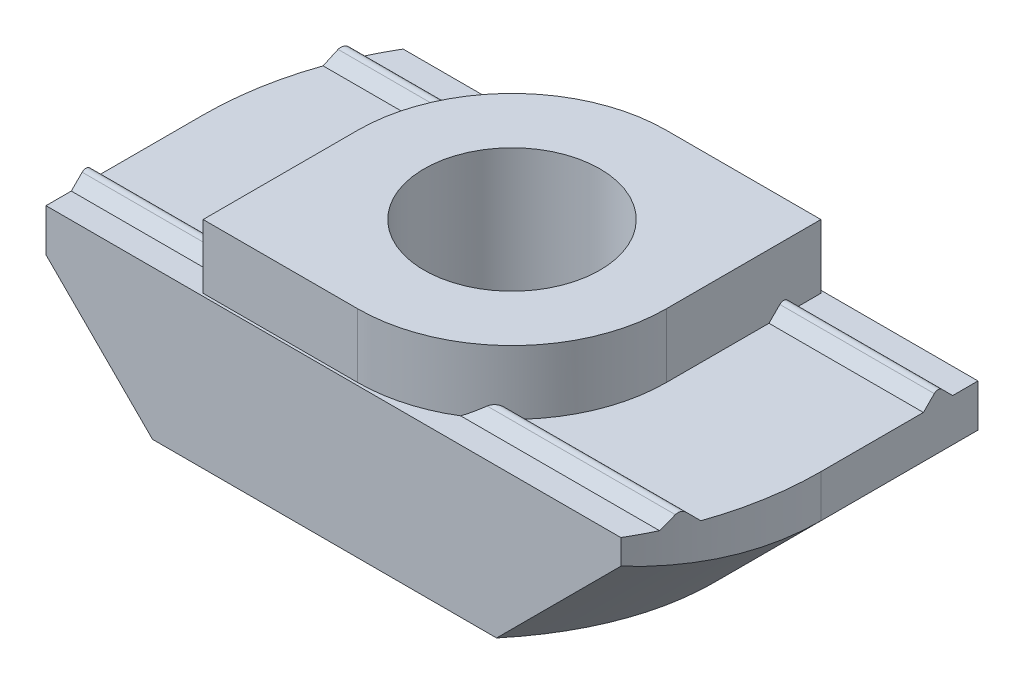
ISO-10303-21;
HEADER;
FILE_DESCRIPTION(('STEP AP214'),'2;1');
FILE_NAME('part.step','',(''),(''),'','','');
FILE_SCHEMA(('AUTOMOTIVE_DESIGN { 1 0 10303 214 1 1 1 1 }'));
ENDSEC;
DATA;
#1=APPLICATION_CONTEXT('core data for automotive mechanical design processes');
#2=APPLICATION_PROTOCOL_DEFINITION('international standard','automotive_design',2000,#1);
#3=PRODUCT_CONTEXT('',#1,'mechanical');
#4=PRODUCT('Part','Part','',(#3));
#5=PRODUCT_RELATED_PRODUCT_CATEGORY('part','',(#4));
#6=PRODUCT_DEFINITION_FORMATION('','',#4);
#7=PRODUCT_DEFINITION_CONTEXT('part definition',#1,'design');
#8=PRODUCT_DEFINITION('design','',#6,#7);
#9=PRODUCT_DEFINITION_SHAPE('','',#8);
#10=(LENGTH_UNIT() NAMED_UNIT(*) SI_UNIT(.MILLI.,.METRE.));
#11=(NAMED_UNIT(*) PLANE_ANGLE_UNIT() SI_UNIT($,.RADIAN.));
#12=(NAMED_UNIT(*) SI_UNIT($,.STERADIAN.) SOLID_ANGLE_UNIT());
#13=UNCERTAINTY_MEASURE_WITH_UNIT(LENGTH_MEASURE(1.E-05),#10,'distance_accuracy_value','');
#14=(GEOMETRIC_REPRESENTATION_CONTEXT(3) GLOBAL_UNCERTAINTY_ASSIGNED_CONTEXT((#13)) GLOBAL_UNIT_ASSIGNED_CONTEXT((#10,
#11,#12)) REPRESENTATION_CONTEXT('',''));
#15=CARTESIAN_POINT('',(0.,0.,0.));
#16=DIRECTION('',(0.,0.,1.));
#17=DIRECTION('',(1.,0.,0.));
#18=AXIS2_PLACEMENT_3D('',#15,#16,#17);
#19=CARTESIAN_POINT('',(5.8,-0.0964213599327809,-2.19999999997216));
#20=DIRECTION('',(-1.,0.,0.));
#21=DIRECTION('',(0.,0.,1.));
#22=AXIS2_PLACEMENT_3D('',#19,#20,#21);
#23=CYLINDRICAL_SURFACE('',#22,0.100000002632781);
#24=CARTESIAN_POINT('',(5.8,-0.0964213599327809,-2.19999999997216));
#25=DIRECTION('',(-1.,0.,0.));
#26=DIRECTION('',(0.,0.,1.));
#27=AXIS2_PLACEMENT_3D('',#24,#25,#26);
#28=CIRCLE('',#27,0.100000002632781);
#29=CARTESIAN_POINT('',(5.8,-0.0257106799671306,-2.12928931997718));
#30=VERTEX_POINT('',#29);
#31=CARTESIAN_POINT('',(5.8,-0.0257106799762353,-2.27071067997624));
#32=VERTEX_POINT('',#31);
#33=EDGE_CURVE('E19',#30,#32,#28,.T.);
#34=ORIENTED_EDGE('',*,*,#33,.T.);
#35=DIRECTION('',(1.,0.,0.));
#36=VECTOR('',#35,1.);
#37=CARTESIAN_POINT('',(5.8,-0.0257106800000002,-2.27071068));
#38=LINE('',#37,#36);
#39=CARTESIAN_POINT('',(2.9,-0.0257106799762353,-2.27071067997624));
#40=VERTEX_POINT('',#39);
#41=EDGE_CURVE('E600',#40,#32,#38,.T.);
#42=ORIENTED_EDGE('',*,*,#41,.F.);
#43=CARTESIAN_POINT('',(2.9,-0.0964213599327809,-2.19999999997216));
#44=DIRECTION('',(-1.,0.,0.));
#45=DIRECTION('',(0.,0.,1.));
#46=AXIS2_PLACEMENT_3D('',#43,#44,#45);
#47=CIRCLE('',#46,0.100000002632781);
#48=CARTESIAN_POINT('',(2.9,-0.0257106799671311,-2.12928931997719));
#49=VERTEX_POINT('',#48);
#50=EDGE_CURVE('E205',#49,#40,#47,.T.);
#51=ORIENTED_EDGE('',*,*,#50,.F.);
#52=DIRECTION('',(1.,0.,0.));
#53=VECTOR('',#52,1.);
#54=CARTESIAN_POINT('',(5.8,-0.0257106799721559,-2.12928931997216));
#55=LINE('',#54,#53);
#56=EDGE_CURVE('E184',#30,#49,#55,.F.);
#57=ORIENTED_EDGE('',*,*,#56,.F.);
#58=EDGE_LOOP('',(#34,#42,#51,#57));
#59=FACE_BOUND('',#58,.T.);
#60=ADVANCED_FACE('F16',(#59),#23,.T.);
#61=CARTESIAN_POINT('',(5.8,-0.0964213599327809,-2.19999999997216));
#62=DIRECTION('',(-1.,0.,0.));
#63=DIRECTION('',(0.,0.,1.));
#64=AXIS2_PLACEMENT_3D('',#61,#62,#63);
#65=CYLINDRICAL_SURFACE('',#64,0.100000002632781);
#66=CARTESIAN_POINT('',(-5.33702848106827,-0.025710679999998,-2.27071068));
#67=CARTESIAN_POINT('',(-5.33882524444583,-0.021484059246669,-2.26648822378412));
#68=CARTESIAN_POINT('',(-5.34076270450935,-0.017676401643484,-2.26191999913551));
#69=CARTESIAN_POINT('',(-5.34484278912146,-0.0109634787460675,-2.25226156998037));
#70=CARTESIAN_POINT('',(-5.34698488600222,-0.00805597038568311,-2.24717270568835));
#71=CARTESIAN_POINT('',(-5.35140504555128,-0.00318900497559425,-2.23662622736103));
#72=CARTESIAN_POINT('',(-5.35368293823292,-0.00122838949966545,-2.23116907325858));
#73=CARTESIAN_POINT('',(-5.35831323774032,0.00172232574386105,-2.22002603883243));
#74=CARTESIAN_POINT('',(-5.36066568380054,0.00271190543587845,-2.21434003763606));
#75=CARTESIAN_POINT('',(-5.36548778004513,0.00372421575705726,-2.20263086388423));
#76=CARTESIAN_POINT('',(-5.36795797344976,0.00370180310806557,-2.1966039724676));
#77=CARTESIAN_POINT('',(-5.37284378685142,0.00257276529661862,-2.18462616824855));
#78=CARTESIAN_POINT('',(-5.37525938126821,0.00146564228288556,-2.17867529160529));
#79=CARTESIAN_POINT('',(-5.37998414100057,-0.00183273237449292,-2.16698194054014));
#80=CARTESIAN_POINT('',(-5.38229238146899,-0.00403198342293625,-2.16124134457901));
#81=CARTESIAN_POINT('',(-5.38670996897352,-0.00948243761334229,-2.15020717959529));
#82=CARTESIAN_POINT('',(-5.38881970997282,-0.0127314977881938,-2.14491272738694));
#83=CARTESIAN_POINT('',(-5.39153718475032,-0.0178730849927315,-2.13806709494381));
#84=CARTESIAN_POINT('',(-5.39226144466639,-0.0193487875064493,-2.13623973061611));
#85=CARTESIAN_POINT('',(-5.39366762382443,-0.0224318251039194,-2.13268684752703));
#86=CARTESIAN_POINT('',(-5.39434959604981,-0.0240389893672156,-2.13096120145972));
#87=CARTESIAN_POINT('',(-5.39500945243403,-0.0257106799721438,-2.12928931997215));
#88=B_SPLINE_CURVE_WITH_KNOTS('',3,(#66,#67,#68,#69,#70,#71,#72,#73,#74,#75,#76,#77,#78,#79,#80,
#81,#82,#83,#84,#85,#86,#87),.UNSPECIFIED.,.F.,.F.,(4,2,2,2,2,2,2,2,2,2,4),(0.,
0.0186784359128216,0.037309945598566,0.05591860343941,0.0745372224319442,0.0939871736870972,
0.113446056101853,0.133049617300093,0.152613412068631,0.1599824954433,0.167342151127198),.UNSPECIFIED.);
#89=CARTESIAN_POINT('',(-5.33702848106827,-0.0257106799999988,-2.27071068));
#90=VERTEX_POINT('',#89);
#91=CARTESIAN_POINT('',(-5.39500945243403,-0.025710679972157,-2.12928931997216));
#92=VERTEX_POINT('',#91);
#93=EDGE_CURVE('E203',#90,#92,#88,.T.);
#94=ORIENTED_EDGE('',*,*,#93,.T.);
#95=DIRECTION('',(1.,0.,0.));
#96=VECTOR('',#95,1.);
#97=CARTESIAN_POINT('',(5.8,-0.0257106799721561,-2.12928931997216));
#98=LINE('',#97,#96);
#99=CARTESIAN_POINT('',(-1.96878820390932,-0.0257106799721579,-2.12928931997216));
#100=VERTEX_POINT('',#99);
#101=EDGE_CURVE('E372',#100,#92,#98,.F.);
#102=ORIENTED_EDGE('',*,*,#101,.F.);
#103=CARTESIAN_POINT('',(-1.80384949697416,-0.025710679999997,-2.27071068));
#104=CARTESIAN_POINT('',(-1.81080343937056,-0.0202346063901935,-2.2651890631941));
#105=CARTESIAN_POINT('',(-1.81809590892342,-0.0156205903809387,-2.25934146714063));
#106=CARTESIAN_POINT('',(-1.83308592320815,-0.00795911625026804,-2.24719503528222));
#107=CARTESIAN_POINT('',(-1.84078228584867,-0.00490734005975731,-2.24089749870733));
#108=CARTESIAN_POINT('',(-1.85841615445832,0.000442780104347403,-2.22630952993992));
#109=CARTESIAN_POINT('',(-1.8684061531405,0.00232595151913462,-2.21793390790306));
#110=CARTESIAN_POINT('',(-1.88840294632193,0.00393944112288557,-2.20093307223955));
#111=CARTESIAN_POINT('',(-1.89840971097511,0.00366379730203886,-2.19230723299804));
#112=CARTESIAN_POINT('',(-1.91576985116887,0.00115657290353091,-2.17713707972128));
#113=CARTESIAN_POINT('',(-1.92318814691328,-0.000594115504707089,-2.1705857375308));
#114=CARTESIAN_POINT('',(-1.93765609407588,-0.00555592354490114,-2.15767970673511));
#115=CARTESIAN_POINT('',(-1.94470747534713,-0.00875933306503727,-2.1513241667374));
#116=CARTESIAN_POINT('',(-1.95448518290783,-0.014589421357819,-2.14242960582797));
#117=CARTESIAN_POINT('',(-1.95745199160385,-0.0165597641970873,-2.13971891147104));
#118=CARTESIAN_POINT('',(-1.96324016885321,-0.0208599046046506,-2.13440941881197));
#119=CARTESIAN_POINT('',(-1.96606109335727,-0.0231907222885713,-2.1318109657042));
#120=CARTESIAN_POINT('',(-1.96878820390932,-0.0257106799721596,-2.12928931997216));
#121=B_SPLINE_CURVE_WITH_KNOTS('',3,(#103,#104,#105,#106,#107,#108,#109,#110,#111,#112,#113,
#114,#115,#116,#117,#118,#119,#120),.UNSPECIFIED.,.F.,.F.,(4,2,2,2,2,2,2,2,4),(0.,
0.0311707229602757,0.062254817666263,0.101591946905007,0.141037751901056,0.171099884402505,
0.201004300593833,0.214415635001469,0.227865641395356),.UNSPECIFIED.);
#122=CARTESIAN_POINT('',(-1.80384949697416,-0.0257106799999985,-2.27071068));
#123=VERTEX_POINT('',#122);
#124=EDGE_CURVE('E350',#123,#100,#121,.T.);
#125=ORIENTED_EDGE('',*,*,#124,.F.);
#126=DIRECTION('',(1.,0.,0.));
#127=VECTOR('',#126,1.);
#128=CARTESIAN_POINT('',(5.8,-0.02571068,-2.27071068));
#129=LINE('',#128,#127);
#130=EDGE_CURVE('E285',#90,#123,#129,.T.);
#131=ORIENTED_EDGE('',*,*,#130,.F.);
#132=EDGE_LOOP('',(#94,#102,#125,#131));
#133=FACE_BOUND('',#132,.T.);
#134=ADVANCED_FACE('F358',(#133),#65,.T.);
#135=CARTESIAN_POINT('',(5.8,-0.127855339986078,-2.02714465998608));
#136=DIRECTION('',(0.,0.707106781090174,0.707106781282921));
#137=DIRECTION('',(0.,-0.707106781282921,0.707106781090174));
#138=AXIS2_PLACEMENT_3D('',#135,#136,#137);
#139=PLANE('',#138);
#140=CARTESIAN_POINT('',(0.,-2.15500000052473,0.));
#141=DIRECTION('',(0.,0.707106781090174,0.707106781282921));
#142=DIRECTION('',(0.,-0.707106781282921,0.707106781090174));
#143=AXIS2_PLACEMENT_3D('',#140,#141,#142);
#144=ELLIPSE('',#143,8.20243866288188,5.8);
#145=CARTESIAN_POINT('',(-5.4712315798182,-0.23,-1.925));
#146=VERTEX_POINT('',#145);
#147=EDGE_CURVE('E373',#92,#146,#144,.T.);
#148=ORIENTED_EDGE('',*,*,#147,.T.);
#149=DIRECTION('',(1.,0.,0.));
#150=VECTOR('',#149,1.);
#151=CARTESIAN_POINT('',(0.,-0.23,-1.925));
#152=LINE('',#151,#150);
#153=CARTESIAN_POINT('',(-2.1689571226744,-0.23,-1.925));
#154=VERTEX_POINT('',#153);
#155=EDGE_CURVE('E281',#154,#146,#152,.F.);
#156=ORIENTED_EDGE('',*,*,#155,.F.);
#157=CARTESIAN_POINT('',(-1.96878820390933,-0.0257106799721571,-2.12928931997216));
#158=CARTESIAN_POINT('',(-1.97743105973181,-0.0337020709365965,-2.12129793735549));
#159=CARTESIAN_POINT('',(-1.98600726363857,-0.0417295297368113,-2.11327058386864));
#160=CARTESIAN_POINT('',(-2.00309851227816,-0.0579224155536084,-2.0970779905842));
#161=CARTESIAN_POINT('',(-2.01161243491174,-0.066088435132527,-2.0889121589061));
#162=CARTESIAN_POINT('',(-2.02857659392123,-0.0825584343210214,-2.07244250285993));
#163=CARTESIAN_POINT('',(-2.03702569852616,-0.0908629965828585,-2.06413809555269));
#164=CARTESIAN_POINT('',(-2.05385767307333,-0.107610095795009,-2.04739121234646));
#165=CARTESIAN_POINT('',(-2.06223940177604,-0.1160532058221,-2.03894816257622));
#166=CARTESIAN_POINT('',(-2.07893405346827,-0.133077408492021,-2.02192396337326));
#167=CARTESIAN_POINT('',(-2.08724582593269,-0.141659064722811,-2.0133422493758));
#168=CARTESIAN_POINT('',(-2.10379797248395,-0.158960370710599,-1.99604073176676));
#169=CARTESIAN_POINT('',(-2.11203718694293,-0.167680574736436,-1.98732037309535));
#170=CARTESIAN_POINT('',(-2.1284416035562,-0.185258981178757,-1.96974162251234));
#171=CARTESIAN_POINT('',(-2.13660563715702,-0.194117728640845,-1.96088268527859));
#172=CARTESIAN_POINT('',(-2.15285705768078,-0.21197324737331,-1.94302686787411));
#173=CARTESIAN_POINT('',(-2.16094326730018,-0.220970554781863,-1.93402945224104));
#174=CARTESIAN_POINT('',(-2.1689571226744,-0.23,-1.925));
#175=B_SPLINE_CURVE_WITH_KNOTS('',3,(#157,#158,#159,#160,#161,#162,#163,#164,#165,#166,#167,
#168,#169,#170,#171,#172,#173,#174),.UNSPECIFIED.,.F.,.F.,(4,2,2,2,2,2,2,2,4),(0.,
0.0426823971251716,0.0857239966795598,0.12912632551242,0.172890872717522,0.217019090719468,
0.261512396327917,0.306372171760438,0.351599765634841),.UNSPECIFIED.);
#176=EDGE_CURVE('E206',#100,#154,#175,.T.);
#177=ORIENTED_EDGE('',*,*,#176,.F.);
#178=ORIENTED_EDGE('',*,*,#101,.T.);
#179=EDGE_LOOP('',(#148,#156,#177,#178));
#180=FACE_BOUND('',#179,.T.);
#181=ADVANCED_FACE('F362',(#180),#139,.T.);
#182=CARTESIAN_POINT('',(5.8,-0.12785534,2.02714466));
#183=DIRECTION('',(0.,0.707106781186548,-0.707106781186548));
#184=DIRECTION('',(0.,0.707106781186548,0.707106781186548));
#185=AXIS2_PLACEMENT_3D('',#182,#183,#184);
#186=PLANE('',#185);
#187=DIRECTION('',(0.,0.707106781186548,0.707106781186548));
#188=VECTOR('',#187,1.);
#189=CARTESIAN_POINT('',(-5.8,-0.12785534,2.02714466));
#190=LINE('',#189,#188);
#191=CARTESIAN_POINT('',(-5.8,-0.23,1.925));
#192=VERTEX_POINT('',#191);
#193=CARTESIAN_POINT('',(-5.8,-0.0257106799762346,2.12928932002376));
#194=VERTEX_POINT('',#193);
#195=EDGE_CURVE('E218',#192,#194,#190,.T.);
#196=ORIENTED_EDGE('',*,*,#195,.T.);
#197=DIRECTION('',(-1.,0.,0.));
#198=VECTOR('',#197,1.);
#199=CARTESIAN_POINT('',(5.8,-0.0257106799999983,2.12928932));
#200=LINE('',#199,#198);
#201=CARTESIAN_POINT('',(-2.9,-0.0257106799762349,2.12928932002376));
#202=VERTEX_POINT('',#201);
#203=EDGE_CURVE('E214',#202,#194,#200,.T.);
#204=ORIENTED_EDGE('',*,*,#203,.F.);
#205=DIRECTION('',(0.,0.707106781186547,0.707106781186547));
#206=VECTOR('',#205,1.);
#207=CARTESIAN_POINT('',(-2.9,-0.23,1.925));
#208=LINE('',#207,#206);
#209=CARTESIAN_POINT('',(-2.9,-0.23,1.925));
#210=VERTEX_POINT('',#209);
#211=EDGE_CURVE('E326',#210,#202,#208,.T.);
#212=ORIENTED_EDGE('',*,*,#211,.F.);
#213=DIRECTION('',(1.,0.,0.));
#214=VECTOR('',#213,1.);
#215=CARTESIAN_POINT('',(0.,-0.23,1.925));
#216=LINE('',#215,#214);
#217=EDGE_CURVE('E582',#192,#210,#216,.T.);
#218=ORIENTED_EDGE('',*,*,#217,.F.);
#219=EDGE_LOOP('',(#196,#204,#212,#218));
#220=FACE_BOUND('',#219,.T.);
#221=ADVANCED_FACE('F636',(#220),#186,.T.);
#222=CARTESIAN_POINT('',(5.8,-0.0964213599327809,2.20000000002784));
#223=DIRECTION('',(-1.,0.,0.));
#224=DIRECTION('',(0.,0.,1.));
#225=AXIS2_PLACEMENT_3D('',#222,#223,#224);
#226=CYLINDRICAL_SURFACE('',#225,0.100000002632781);
#227=CARTESIAN_POINT('',(-5.8,-0.0964213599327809,2.20000000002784));
#228=DIRECTION('',(-1.,0.,0.));
#229=DIRECTION('',(0.,0.,1.));
#230=AXIS2_PLACEMENT_3D('',#227,#228,#229);
#231=CIRCLE('',#230,0.100000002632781);
#232=CARTESIAN_POINT('',(-5.8,-0.0257106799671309,2.27071068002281));
#233=VERTEX_POINT('',#232);
#234=EDGE_CURVE('E217',#194,#233,#231,.F.);
#235=ORIENTED_EDGE('',*,*,#234,.T.);
#236=DIRECTION('',(1.,0.,0.));
#237=VECTOR('',#236,1.);
#238=CARTESIAN_POINT('',(5.8,-0.0257106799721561,2.27071068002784));
#239=LINE('',#238,#237);
#240=CARTESIAN_POINT('',(-2.9,-0.025710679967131,2.27071068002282));
#241=VERTEX_POINT('',#240);
#242=EDGE_CURVE('E277',#241,#233,#239,.F.);
#243=ORIENTED_EDGE('',*,*,#242,.F.);
#244=CARTESIAN_POINT('',(-2.9,-0.0964213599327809,2.20000000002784));
#245=DIRECTION('',(-1.,0.,0.));
#246=DIRECTION('',(0.,0.,1.));
#247=AXIS2_PLACEMENT_3D('',#244,#245,#246);
#248=CIRCLE('',#247,0.100000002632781);
#249=EDGE_CURVE('E303',#202,#241,#248,.F.);
#250=ORIENTED_EDGE('',*,*,#249,.F.);
#251=ORIENTED_EDGE('',*,*,#203,.T.);
#252=EDGE_LOOP('',(#235,#243,#250,#251));
#253=FACE_BOUND('',#252,.T.);
#254=ADVANCED_FACE('F481',(#253),#226,.T.);
#255=CARTESIAN_POINT('',(5.8,-0.0964213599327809,2.20000000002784));
#256=DIRECTION('',(-1.,0.,0.));
#257=DIRECTION('',(0.,0.,1.));
#258=AXIS2_PLACEMENT_3D('',#255,#256,#257);
#259=CYLINDRICAL_SURFACE('',#258,0.100000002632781);
#260=CARTESIAN_POINT('',(5.33702848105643,-0.0257106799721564,2.27071068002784));
#261=CARTESIAN_POINT('',(5.3388252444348,-0.0214840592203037,2.26648822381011));
#262=CARTESIAN_POINT('',(5.34076270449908,-0.0176764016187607,2.26191999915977));
#263=CARTESIAN_POINT('',(5.34484278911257,-0.0109634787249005,2.25226157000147));
#264=CARTESIAN_POINT('',(5.34698488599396,-0.00805597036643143,2.24717270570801));
#265=CARTESIAN_POINT('',(5.35140504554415,-0.00318900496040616,2.2366262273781));
#266=CARTESIAN_POINT('',(5.35368293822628,-0.0012283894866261,2.2311690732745));
#267=CARTESIAN_POINT('',(5.35831323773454,0.00172232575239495,2.22002603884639));
#268=CARTESIAN_POINT('',(5.36066568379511,0.00271190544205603,2.21434003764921));
#269=CARTESIAN_POINT('',(5.36548778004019,0.00372421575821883,2.20263086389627));
#270=CARTESIAN_POINT('',(5.36795797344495,0.00370180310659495,2.19660397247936));
#271=CARTESIAN_POINT('',(5.37284378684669,0.00257276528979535,2.18462616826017));
#272=CARTESIAN_POINT('',(5.37525938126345,0.00146564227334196,2.17867529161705));
#273=CARTESIAN_POINT('',(5.37998414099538,-0.00183273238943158,2.16698194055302));
#274=CARTESIAN_POINT('',(5.38229238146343,-0.00403198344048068,2.16124134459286));
#275=CARTESIAN_POINT('',(5.38670996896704,-0.00948243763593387,2.15020717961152));
#276=CARTESIAN_POINT('',(5.3888197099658,-0.0127314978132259,2.14491272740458));
#277=CARTESIAN_POINT('',(5.3915371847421,-0.0178730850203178,2.13806709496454));
#278=CARTESIAN_POINT('',(5.3922614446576,-0.0193487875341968,2.13623973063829));
#279=CARTESIAN_POINT('',(5.39366762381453,-0.0224318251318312,2.13268684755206));
#280=CARTESIAN_POINT('',(5.39434959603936,-0.0240389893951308,2.13096120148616));
#281=CARTESIAN_POINT('',(5.39500945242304,-0.0257106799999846,2.12928931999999));
#282=B_SPLINE_CURVE_WITH_KNOTS('',3,(#260,#261,#262,#263,#264,#265,#266,#267,#268,#269,#270,
#271,#272,#273,#274,#275,#276,#277,#278,#279,#280,#281),.UNSPECIFIED.,.F.,.F.,(4,2,2,2,2,2,2,2,
2,2,4),(0.,0.0186784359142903,0.0373099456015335,0.0559186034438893,0.0745372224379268,
0.0939871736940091,0.113446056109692,0.133049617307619,0.152613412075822,0.159982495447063,
0.167342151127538),.UNSPECIFIED.);
#283=CARTESIAN_POINT('',(5.33702848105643,-0.0257106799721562,2.27071068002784));
#284=VERTEX_POINT('',#283);
#285=CARTESIAN_POINT('',(5.39500945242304,-0.0257106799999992,2.12928932));
#286=VERTEX_POINT('',#285);
#287=EDGE_CURVE('E471',#284,#286,#282,.T.);
#288=ORIENTED_EDGE('',*,*,#287,.T.);
#289=DIRECTION('',(1.,0.,0.));
#290=VECTOR('',#289,1.);
#291=CARTESIAN_POINT('',(5.8,-0.0257106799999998,2.12928932));
#292=LINE('',#291,#290);
#293=CARTESIAN_POINT('',(1.96878820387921,-0.0257106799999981,2.12928932));
#294=VERTEX_POINT('',#293);
#295=EDGE_CURVE('E476',#294,#286,#292,.T.);
#296=ORIENTED_EDGE('',*,*,#295,.F.);
#297=CARTESIAN_POINT('',(1.80384949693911,-0.0257106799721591,2.27071068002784));
#298=CARTESIAN_POINT('',(1.81080343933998,-0.0202346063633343,2.26518906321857));
#299=CARTESIAN_POINT('',(1.81809590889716,-0.0156205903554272,2.25934146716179));
#300=CARTESIAN_POINT('',(1.8330859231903,-0.00795911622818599,2.2471950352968));
#301=CARTESIAN_POINT('',(1.84078228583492,-0.00490734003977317,2.24089749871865));
#302=CARTESIAN_POINT('',(1.85841615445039,0.000442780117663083,2.22630952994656));
#303=CARTESIAN_POINT('',(1.86840615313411,0.00232595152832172,2.21793390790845));
#304=CARTESIAN_POINT('',(1.88840294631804,0.00393944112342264,2.20093307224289));
#305=CARTESIAN_POINT('',(1.89840971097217,0.00366379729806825,2.19230723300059));
#306=CARTESIAN_POINT('',(1.91576985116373,0.00115657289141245,2.17713707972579));
#307=CARTESIAN_POINT('',(1.9231881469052,-0.000594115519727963,2.17058573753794));
#308=CARTESIAN_POINT('',(1.93765609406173,-0.00555592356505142,2.15767970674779));
#309=CARTESIAN_POINT('',(1.94470747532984,-0.00875933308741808,2.15132416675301));
#310=CARTESIAN_POINT('',(1.95448518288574,-0.014589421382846,2.14242960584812));
#311=CARTESIAN_POINT('',(1.95745199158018,-0.0165597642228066,2.13971891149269));
#312=CARTESIAN_POINT('',(1.96324016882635,-0.0208599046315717,2.13440941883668));
#313=CARTESIAN_POINT('',(1.96606109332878,-0.0231907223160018,2.13181096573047));
#314=CARTESIAN_POINT('',(1.96878820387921,-0.0257106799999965,2.12928932));
#315=B_SPLINE_CURVE_WITH_KNOTS('',3,(#297,#298,#299,#300,#301,#302,#303,#304,#305,#306,#307,
#308,#309,#310,#311,#312,#313,#314),.UNSPECIFIED.,.F.,.F.,(4,2,2,2,2,2,2,2,4),(0.,
0.0311707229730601,0.0622548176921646,0.101591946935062,0.141037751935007,0.171099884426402,
0.201004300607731,0.214415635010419,0.227865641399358),.UNSPECIFIED.);
#316=CARTESIAN_POINT('',(1.80384949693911,-0.0257106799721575,2.27071068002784));
#317=VERTEX_POINT('',#316);
#318=EDGE_CURVE('E295',#317,#294,#315,.T.);
#319=ORIENTED_EDGE('',*,*,#318,.F.);
#320=DIRECTION('',(1.,0.,0.));
#321=VECTOR('',#320,1.);
#322=CARTESIAN_POINT('',(5.8,-0.0257106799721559,2.27071068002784));
#323=LINE('',#322,#321);
#324=EDGE_CURVE('E273',#284,#317,#323,.F.);
#325=ORIENTED_EDGE('',*,*,#324,.F.);
#326=EDGE_LOOP('',(#288,#296,#319,#325));
#327=FACE_BOUND('',#326,.T.);
#328=ADVANCED_FACE('F305',(#327),#259,.T.);
#329=CARTESIAN_POINT('',(5.8,-0.12785534,2.02714466));
#330=DIRECTION('',(0.,0.707106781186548,-0.707106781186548));
#331=DIRECTION('',(0.,0.707106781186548,0.707106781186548));
#332=AXIS2_PLACEMENT_3D('',#329,#330,#331);
#333=PLANE('',#332);
#334=CARTESIAN_POINT('',(0.,-2.155,0.));
#335=DIRECTION('',(0.,0.707106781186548,-0.707106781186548));
#336=DIRECTION('',(0.,-0.707106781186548,-0.707106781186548));
#337=AXIS2_PLACEMENT_3D('',#334,#335,#336);
#338=ELLIPSE('',#337,8.20243866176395,5.8);
#339=CARTESIAN_POINT('',(5.4712315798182,-0.23,1.925));
#340=VERTEX_POINT('',#339);
#341=EDGE_CURVE('E191',#286,#340,#338,.T.);
#342=ORIENTED_EDGE('',*,*,#341,.T.);
#343=DIRECTION('',(1.,0.,0.));
#344=VECTOR('',#343,1.);
#345=CARTESIAN_POINT('',(0.,-0.23,1.925));
#346=LINE('',#345,#344);
#347=CARTESIAN_POINT('',(2.1689571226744,-0.23,1.925));
#348=VERTEX_POINT('',#347);
#349=EDGE_CURVE('E269',#348,#340,#346,.T.);
#350=ORIENTED_EDGE('',*,*,#349,.F.);
#351=CARTESIAN_POINT('',(1.96878820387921,-0.0257106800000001,2.12928932));
#352=CARTESIAN_POINT('',(1.97743105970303,-0.0337020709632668,2.12129793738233));
#353=CARTESIAN_POINT('',(1.98600726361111,-0.041729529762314,2.11327058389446));
#354=CARTESIAN_POINT('',(2.00309851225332,-0.0579224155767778,2.09707799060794));
#355=CARTESIAN_POINT('',(2.0116124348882,-0.0660884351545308,2.08891215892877));
#356=CARTESIAN_POINT('',(2.02857659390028,-0.0825584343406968,2.07244250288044));
#357=CARTESIAN_POINT('',(2.0370256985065,-0.0908629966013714,2.0641380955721));
#358=CARTESIAN_POINT('',(2.05385767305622,-0.107610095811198,2.04739121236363));
#359=CARTESIAN_POINT('',(2.0622394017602,-0.116053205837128,2.03894816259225));
#360=CARTESIAN_POINT('',(2.07893405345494,-0.133077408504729,2.02192396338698));
#361=CARTESIAN_POINT('',(2.08724582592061,-0.14165906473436,2.01334224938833));
#362=CARTESIAN_POINT('',(2.10379797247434,-0.158960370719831,1.9960407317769));
#363=CARTESIAN_POINT('',(2.11203718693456,-0.167680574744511,1.98732037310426));
#364=CARTESIAN_POINT('',(2.12844160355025,-0.18525898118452,1.96974162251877));
#365=CARTESIAN_POINT('',(2.13660563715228,-0.194117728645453,1.96088268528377));
#366=CARTESIAN_POINT('',(2.15285705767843,-0.211973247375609,1.94302686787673));
#367=CARTESIAN_POINT('',(2.16094326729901,-0.220970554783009,1.93402945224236));
#368=CARTESIAN_POINT('',(2.1689571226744,-0.23,1.925));
#369=B_SPLINE_CURVE_WITH_KNOTS('',3,(#351,#352,#353,#354,#355,#356,#357,#358,#359,#360,#361,
#362,#363,#364,#365,#366,#367,#368),.UNSPECIFIED.,.F.,.F.,(4,2,2,2,2,2,2,2,4),(0.,
0.0426823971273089,0.085723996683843,0.129126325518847,0.172890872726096,0.217019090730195,
0.261512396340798,0.30637217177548,0.351599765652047),.UNSPECIFIED.);
#370=EDGE_CURVE('E294',#294,#348,#369,.T.);
#371=ORIENTED_EDGE('',*,*,#370,.F.);
#372=ORIENTED_EDGE('',*,*,#295,.T.);
#373=EDGE_LOOP('',(#342,#350,#371,#372));
#374=FACE_BOUND('',#373,.T.);
#375=ADVANCED_FACE('F729',(#374),#333,.T.);
#376=CARTESIAN_POINT('',(5.8,-0.127855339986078,-2.02714465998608));
#377=DIRECTION('',(0.,0.707106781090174,0.707106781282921));
#378=DIRECTION('',(0.,-0.707106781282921,0.707106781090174));
#379=AXIS2_PLACEMENT_3D('',#376,#377,#378);
#380=PLANE('',#379);
#381=DIRECTION('',(0.,-0.707106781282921,0.707106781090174));
#382=VECTOR('',#381,1.);
#383=CARTESIAN_POINT('',(5.8,-0.127855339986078,-2.02714465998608));
#384=LINE('',#383,#382);
#385=CARTESIAN_POINT('',(5.8,-0.23,-1.925));
#386=VERTEX_POINT('',#385);
#387=EDGE_CURVE('E179',#386,#30,#384,.F.);
#388=ORIENTED_EDGE('',*,*,#387,.T.);
#389=ORIENTED_EDGE('',*,*,#56,.T.);
#390=DIRECTION('',(0.,0.707106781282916,-0.70710678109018));
#391=VECTOR('',#390,1.);
#392=CARTESIAN_POINT('',(2.9,-0.23,-1.925));
#393=LINE('',#392,#391);
#394=CARTESIAN_POINT('',(2.9,-0.23,-1.925));
#395=VERTEX_POINT('',#394);
#396=EDGE_CURVE('E291',#395,#49,#393,.T.);
#397=ORIENTED_EDGE('',*,*,#396,.F.);
#398=DIRECTION('',(1.,0.,0.));
#399=VECTOR('',#398,1.);
#400=CARTESIAN_POINT('',(0.,-0.23,-1.925));
#401=LINE('',#400,#399);
#402=EDGE_CURVE('E187',#386,#395,#401,.F.);
#403=ORIENTED_EDGE('',*,*,#402,.F.);
#404=EDGE_LOOP('',(#388,#389,#397,#403));
#405=FACE_BOUND('',#404,.T.);
#406=ADVANCED_FACE('F181',(#405),#380,.T.);
#407=CARTESIAN_POINT('',(0.,0.97,0.));
#408=DIRECTION('',(0.,-1.,0.));
#409=DIRECTION('',(0.,0.,-1.));
#410=AXIS2_PLACEMENT_3D('',#407,#408,#409);
#411=CYLINDRICAL_SURFACE('',#410,2.9);
#412=CARTESIAN_POINT('',(0.,2.245,0.));
#413=DIRECTION('',(0.,0.707106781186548,-0.707106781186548));
#414=DIRECTION('',(0.,-0.707106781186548,-0.707106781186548));
#415=AXIS2_PLACEMENT_3D('',#412,#413,#414);
#416=ELLIPSE('',#415,4.10121933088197,2.9);
#417=CARTESIAN_POINT('',(-1.51141490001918,-0.23,-2.475));
#418=VERTEX_POINT('',#417);
#419=EDGE_CURVE('E286',#123,#418,#416,.F.);
#420=ORIENTED_EDGE('',*,*,#419,.F.);
#421=ORIENTED_EDGE('',*,*,#124,.T.);
#422=ORIENTED_EDGE('',*,*,#176,.T.);
#423=CARTESIAN_POINT('',(0.,-0.23,0.));
#424=DIRECTION('',(0.,-1.,0.));
#425=DIRECTION('',(0.,0.,-1.));
#426=AXIS2_PLACEMENT_3D('',#423,#424,#425);
#427=CIRCLE('',#426,2.9);
#428=CARTESIAN_POINT('',(-2.9,-0.23,0.));
#429=VERTEX_POINT('',#428);
#430=EDGE_CURVE('E278',#429,#154,#427,.T.);
#431=ORIENTED_EDGE('',*,*,#430,.F.);
#432=DIRECTION('',(0.,1.,0.));
#433=VECTOR('',#432,1.);
#434=CARTESIAN_POINT('',(-2.9,0.97,0.));
#435=LINE('',#434,#433);
#436=CARTESIAN_POINT('',(-2.9,0.97,0.));
#437=VERTEX_POINT('',#436);
#438=EDGE_CURVE('E333',#437,#429,#435,.F.);
#439=ORIENTED_EDGE('',*,*,#438,.F.);
#440=CARTESIAN_POINT('',(0.,0.97,0.));
#441=DIRECTION('',(0.,-1.,0.));
#442=DIRECTION('',(0.,0.,-1.));
#443=AXIS2_PLACEMENT_3D('',#440,#441,#442);
#444=CIRCLE('',#443,2.9);
#445=CARTESIAN_POINT('',(0.,0.969999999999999,-2.9));
#446=VERTEX_POINT('',#445);
#447=EDGE_CURVE('E262',#446,#437,#444,.F.);
#448=ORIENTED_EDGE('',*,*,#447,.F.);
#449=DIRECTION('',(0.,1.,0.));
#450=VECTOR('',#449,1.);
#451=CARTESIAN_POINT('',(0.,0.969999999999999,-2.9));
#452=LINE('',#451,#450);
#453=CARTESIAN_POINT('',(0.,-0.23,-2.9));
#454=VERTEX_POINT('',#453);
#455=EDGE_CURVE('E609',#454,#446,#452,.T.);
#456=ORIENTED_EDGE('',*,*,#455,.F.);
#457=CARTESIAN_POINT('',(0.,-0.23,0.));
#458=DIRECTION('',(0.,-1.,0.));
#459=DIRECTION('',(0.,0.,-1.));
#460=AXIS2_PLACEMENT_3D('',#457,#458,#459);
#461=CIRCLE('',#460,2.9);
#462=EDGE_CURVE('E208',#454,#418,#461,.F.);
#463=ORIENTED_EDGE('',*,*,#462,.T.);
#464=EDGE_LOOP('',(#420,#421,#422,#431,#439,#448,#456,#463));
#465=FACE_BOUND('',#464,.T.);
#466=ADVANCED_FACE('F339',(#465),#411,.T.);
#467=CARTESIAN_POINT('',(-2.9,0.97,1.45));
#468=DIRECTION('',(-1.,0.,0.));
#469=DIRECTION('',(0.,0.,1.));
#470=AXIS2_PLACEMENT_3D('',#467,#468,#469);
#471=PLANE('',#470);
#472=ORIENTED_EDGE('',*,*,#211,.T.);
#473=ORIENTED_EDGE('',*,*,#249,.T.);
#474=DIRECTION('',(0.,-0.707106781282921,0.707106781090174));
#475=VECTOR('',#474,1.);
#476=CARTESIAN_POINT('',(-2.9,-0.127855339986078,2.37285534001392));
#477=LINE('',#476,#475);
#478=CARTESIAN_POINT('',(-2.9,-0.23,2.475));
#479=VERTEX_POINT('',#478);
#480=EDGE_CURVE('E493',#479,#241,#477,.F.);
#481=ORIENTED_EDGE('',*,*,#480,.F.);
#482=DIRECTION('',(0.,0.,1.));
#483=VECTOR('',#482,1.);
#484=CARTESIAN_POINT('',(-2.9,-0.23,1.45));
#485=LINE('',#484,#483);
#486=CARTESIAN_POINT('',(-2.9,-0.23,2.9));
#487=VERTEX_POINT('',#486);
#488=EDGE_CURVE('E336',#479,#487,#485,.T.);
#489=ORIENTED_EDGE('',*,*,#488,.T.);
#490=DIRECTION('',(0.,-1.,0.));
#491=VECTOR('',#490,1.);
#492=CARTESIAN_POINT('',(-2.9,0.970000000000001,2.9));
#493=LINE('',#492,#491);
#494=CARTESIAN_POINT('',(-2.9,0.970000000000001,2.9));
#495=VERTEX_POINT('',#494);
#496=EDGE_CURVE('E270',#495,#487,#493,.T.);
#497=ORIENTED_EDGE('',*,*,#496,.F.);
#498=DIRECTION('',(0.,0.,1.));
#499=VECTOR('',#498,1.);
#500=CARTESIAN_POINT('',(-2.9,0.97,0.));
#501=LINE('',#500,#499);
#502=EDGE_CURVE('E264',#437,#495,#501,.T.);
#503=ORIENTED_EDGE('',*,*,#502,.F.);
#504=ORIENTED_EDGE('',*,*,#438,.T.);
#505=DIRECTION('',(0.,0.,1.));
#506=VECTOR('',#505,1.);
#507=CARTESIAN_POINT('',(-2.9,-0.23,0.));
#508=LINE('',#507,#506);
#509=EDGE_CURVE('E282',#210,#429,#508,.F.);
#510=ORIENTED_EDGE('',*,*,#509,.F.);
#511=EDGE_LOOP('',(#472,#473,#481,#489,#497,#503,#504,#510));
#512=FACE_BOUND('',#511,.T.);
#513=ADVANCED_FACE('F315',(#512),#471,.T.);
#514=CARTESIAN_POINT('',(0.,0.97,0.));
#515=DIRECTION('',(0.,-1.,0.));
#516=DIRECTION('',(0.,0.,-1.));
#517=AXIS2_PLACEMENT_3D('',#514,#515,#516);
#518=CYLINDRICAL_SURFACE('',#517,2.9);
#519=DIRECTION('',(0.,-1.,0.));
#520=VECTOR('',#519,1.);
#521=CARTESIAN_POINT('',(0.,0.970000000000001,2.9));
#522=LINE('',#521,#520);
#523=CARTESIAN_POINT('',(0.,-0.23,2.9));
#524=VERTEX_POINT('',#523);
#525=CARTESIAN_POINT('',(0.,0.970000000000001,2.9));
#526=VERTEX_POINT('',#525);
#527=EDGE_CURVE('E569',#524,#526,#522,.F.);
#528=ORIENTED_EDGE('',*,*,#527,.F.);
#529=CARTESIAN_POINT('',(0.,-0.23,0.));
#530=DIRECTION('',(0.,-1.,0.));
#531=DIRECTION('',(0.,0.,-1.));
#532=AXIS2_PLACEMENT_3D('',#529,#530,#531);
#533=CIRCLE('',#532,2.9);
#534=CARTESIAN_POINT('',(1.51141490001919,-0.23,2.475));
#535=VERTEX_POINT('',#534);
#536=EDGE_CURVE('E292',#524,#535,#533,.F.);
#537=ORIENTED_EDGE('',*,*,#536,.T.);
#538=CARTESIAN_POINT('',(0.,2.24500000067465,0.));
#539=DIRECTION('',(0.,0.707106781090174,0.707106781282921));
#540=DIRECTION('',(0.,-0.707106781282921,0.707106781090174));
#541=AXIS2_PLACEMENT_3D('',#538,#539,#540);
#542=ELLIPSE('',#541,4.10121933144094,2.9);
#543=EDGE_CURVE('E274',#317,#535,#542,.F.);
#544=ORIENTED_EDGE('',*,*,#543,.F.);
#545=ORIENTED_EDGE('',*,*,#318,.T.);
#546=ORIENTED_EDGE('',*,*,#370,.T.);
#547=CARTESIAN_POINT('',(0.,-0.23,0.));
#548=DIRECTION('',(0.,-1.,0.));
#549=DIRECTION('',(0.,0.,-1.));
#550=AXIS2_PLACEMENT_3D('',#547,#548,#549);
#551=CIRCLE('',#550,2.9);
#552=CARTESIAN_POINT('',(2.9,-0.23,0.));
#553=VERTEX_POINT('',#552);
#554=EDGE_CURVE('E266',#553,#348,#551,.T.);
#555=ORIENTED_EDGE('',*,*,#554,.F.);
#556=DIRECTION('',(0.,1.,0.));
#557=VECTOR('',#556,1.);
#558=CARTESIAN_POINT('',(2.9,0.97,0.));
#559=LINE('',#558,#557);
#560=CARTESIAN_POINT('',(2.9,0.97,0.));
#561=VERTEX_POINT('',#560);
#562=EDGE_CURVE('E324',#561,#553,#559,.F.);
#563=ORIENTED_EDGE('',*,*,#562,.F.);
#564=CARTESIAN_POINT('',(0.,0.97,0.));
#565=DIRECTION('',(0.,-1.,0.));
#566=DIRECTION('',(0.,0.,-1.));
#567=AXIS2_PLACEMENT_3D('',#564,#565,#566);
#568=CIRCLE('',#567,2.9);
#569=EDGE_CURVE('E258',#526,#561,#568,.F.);
#570=ORIENTED_EDGE('',*,*,#569,.F.);
#571=EDGE_LOOP('',(#528,#537,#544,#545,#546,#555,#563,#570));
#572=FACE_BOUND('',#571,.T.);
#573=ADVANCED_FACE('F309',(#572),#518,.T.);
#574=CARTESIAN_POINT('',(2.9,0.97,-1.45));
#575=DIRECTION('',(1.,0.,0.));
#576=DIRECTION('',(0.,0.,-1.));
#577=AXIS2_PLACEMENT_3D('',#574,#575,#576);
#578=PLANE('',#577);
#579=ORIENTED_EDGE('',*,*,#562,.T.);
#580=DIRECTION('',(0.,0.,1.));
#581=VECTOR('',#580,1.);
#582=CARTESIAN_POINT('',(2.9,-0.23,0.));
#583=LINE('',#582,#581);
#584=EDGE_CURVE('E550',#395,#553,#583,.T.);
#585=ORIENTED_EDGE('',*,*,#584,.F.);
#586=ORIENTED_EDGE('',*,*,#396,.T.);
#587=ORIENTED_EDGE('',*,*,#50,.T.);
#588=DIRECTION('',(0.,0.707106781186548,0.707106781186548));
#589=VECTOR('',#588,1.);
#590=CARTESIAN_POINT('',(2.9,-0.12785534,-2.37285534));
#591=LINE('',#590,#589);
#592=CARTESIAN_POINT('',(2.9,-0.23,-2.475));
#593=VERTEX_POINT('',#592);
#594=EDGE_CURVE('E603',#593,#40,#591,.T.);
#595=ORIENTED_EDGE('',*,*,#594,.F.);
#596=DIRECTION('',(0.,0.,-1.));
#597=VECTOR('',#596,1.);
#598=CARTESIAN_POINT('',(2.9,-0.23,-1.45));
#599=LINE('',#598,#597);
#600=CARTESIAN_POINT('',(2.9,-0.23,-2.9));
#601=VERTEX_POINT('',#600);
#602=EDGE_CURVE('E290',#593,#601,#599,.T.);
#603=ORIENTED_EDGE('',*,*,#602,.T.);
#604=DIRECTION('',(0.,1.,0.));
#605=VECTOR('',#604,1.);
#606=CARTESIAN_POINT('',(2.9,0.969999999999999,-2.9));
#607=LINE('',#606,#605);
#608=CARTESIAN_POINT('',(2.9,0.969999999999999,-2.9));
#609=VERTEX_POINT('',#608);
#610=EDGE_CURVE('E606',#609,#601,#607,.F.);
#611=ORIENTED_EDGE('',*,*,#610,.F.);
#612=DIRECTION('',(0.,0.,1.));
#613=VECTOR('',#612,1.);
#614=CARTESIAN_POINT('',(2.9,0.97,0.));
#615=LINE('',#614,#613);
#616=EDGE_CURVE('E260',#561,#609,#615,.F.);
#617=ORIENTED_EDGE('',*,*,#616,.F.);
#618=EDGE_LOOP('',(#579,#585,#586,#587,#595,#603,#611,#617));
#619=FACE_BOUND('',#618,.T.);
#620=ADVANCED_FACE('F314',(#619),#578,.T.);
#621=CARTESIAN_POINT('',(1.45,0.969999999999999,-2.9));
#622=DIRECTION('',(0.,0.,-1.));
#623=DIRECTION('',(0.,1.,0.));
#624=AXIS2_PLACEMENT_3D('',#621,#622,#623);
#625=PLANE('',#624);
#626=DIRECTION('',(1.,0.,0.));
#627=VECTOR('',#626,1.);
#628=CARTESIAN_POINT('',(0.,0.969999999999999,-2.9));
#629=LINE('',#628,#627);
#630=EDGE_CURVE('E265',#609,#446,#629,.F.);
#631=ORIENTED_EDGE('',*,*,#630,.F.);
#632=ORIENTED_EDGE('',*,*,#610,.T.);
#633=DIRECTION('',(1.,0.,0.));
#634=VECTOR('',#633,1.);
#635=CARTESIAN_POINT('',(0.,-0.230000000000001,-2.9));
#636=LINE('',#635,#634);
#637=EDGE_CURVE('E526',#454,#601,#636,.T.);
#638=ORIENTED_EDGE('',*,*,#637,.F.);
#639=ORIENTED_EDGE('',*,*,#455,.T.);
#640=EDGE_LOOP('',(#631,#632,#638,#639));
#641=FACE_BOUND('',#640,.T.);
#642=ADVANCED_FACE('F417',(#641),#625,.T.);
#643=CARTESIAN_POINT('',(5.8,-0.12785534,-2.37285534));
#644=DIRECTION('',(0.,0.707106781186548,-0.707106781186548));
#645=DIRECTION('',(0.,0.707106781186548,0.707106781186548));
#646=AXIS2_PLACEMENT_3D('',#643,#644,#645);
#647=PLANE('',#646);
#648=DIRECTION('',(0.,0.707106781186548,0.707106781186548));
#649=VECTOR('',#648,1.);
#650=CARTESIAN_POINT('',(5.8,-0.12785534,-2.37285534));
#651=LINE('',#650,#649);
#652=CARTESIAN_POINT('',(5.8,-0.23,-2.475));
#653=VERTEX_POINT('',#652);
#654=EDGE_CURVE('E199',#32,#653,#651,.F.);
#655=ORIENTED_EDGE('',*,*,#654,.T.);
#656=DIRECTION('',(1.,0.,0.));
#657=VECTOR('',#656,1.);
#658=CARTESIAN_POINT('',(0.,-0.23,-2.475));
#659=LINE('',#658,#657);
#660=EDGE_CURVE('E525',#593,#653,#659,.T.);
#661=ORIENTED_EDGE('',*,*,#660,.F.);
#662=ORIENTED_EDGE('',*,*,#594,.T.);
#663=ORIENTED_EDGE('',*,*,#41,.T.);
#664=EDGE_LOOP('',(#655,#661,#662,#663));
#665=FACE_BOUND('',#664,.T.);
#666=ADVANCED_FACE('F414',(#665),#647,.T.);
#667=CARTESIAN_POINT('',(5.8,-0.12785534,-2.37285534));
#668=DIRECTION('',(0.,0.707106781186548,-0.707106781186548));
#669=DIRECTION('',(0.,0.707106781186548,0.707106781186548));
#670=AXIS2_PLACEMENT_3D('',#667,#668,#669);
#671=PLANE('',#670);
#672=CARTESIAN_POINT('',(0.,2.245,0.));
#673=DIRECTION('',(0.,0.707106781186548,-0.707106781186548));
#674=DIRECTION('',(0.,-0.707106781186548,-0.707106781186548));
#675=AXIS2_PLACEMENT_3D('',#672,#673,#674);
#676=ELLIPSE('',#675,8.20243866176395,5.8);
#677=CARTESIAN_POINT('',(-5.24541466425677,-0.23,-2.475));
#678=VERTEX_POINT('',#677);
#679=EDGE_CURVE('E283',#678,#90,#676,.T.);
#680=ORIENTED_EDGE('',*,*,#679,.T.);
#681=ORIENTED_EDGE('',*,*,#130,.T.);
#682=ORIENTED_EDGE('',*,*,#419,.T.);
#683=DIRECTION('',(1.,0.,0.));
#684=VECTOR('',#683,1.);
#685=CARTESIAN_POINT('',(0.,-0.23,-2.475));
#686=LINE('',#685,#684);
#687=EDGE_CURVE('E257',#678,#418,#686,.T.);
#688=ORIENTED_EDGE('',*,*,#687,.F.);
#689=EDGE_LOOP('',(#680,#681,#682,#688));
#690=FACE_BOUND('',#689,.T.);
#691=ADVANCED_FACE('F410',(#690),#671,.T.);
#692=CARTESIAN_POINT('',(0.,-0.23,0.));
#693=DIRECTION('',(0.,1.,0.));
#694=DIRECTION('',(0.,0.,1.));
#695=AXIS2_PLACEMENT_3D('',#692,#693,#694);
#696=PLANE('',#695);
#697=DIRECTION('',(0.,0.,-1.));
#698=VECTOR('',#697,1.);
#699=CARTESIAN_POINT('',(-5.8,-0.23,0.));
#700=LINE('',#699,#698);
#701=CARTESIAN_POINT('',(-5.8,-0.23,0.));
#702=VERTEX_POINT('',#701);
#703=EDGE_CURVE('E499',#702,#192,#700,.F.);
#704=ORIENTED_EDGE('',*,*,#703,.T.);
#705=ORIENTED_EDGE('',*,*,#217,.T.);
#706=ORIENTED_EDGE('',*,*,#509,.T.);
#707=ORIENTED_EDGE('',*,*,#430,.T.);
#708=ORIENTED_EDGE('',*,*,#155,.T.);
#709=CARTESIAN_POINT('',(0.,-0.23,0.));
#710=DIRECTION('',(0.,-1.,0.));
#711=DIRECTION('',(0.,0.,-1.));
#712=AXIS2_PLACEMENT_3D('',#709,#710,#711);
#713=CIRCLE('',#712,5.8);
#714=EDGE_CURVE('E254',#702,#146,#713,.T.);
#715=ORIENTED_EDGE('',*,*,#714,.F.);
#716=EDGE_LOOP('',(#704,#705,#706,#707,#708,#715));
#717=FACE_BOUND('',#716,.T.);
#718=ADVANCED_FACE('F406',(#717),#696,.T.);
#719=CARTESIAN_POINT('',(5.8,-0.127855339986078,2.37285534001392));
#720=DIRECTION('',(0.,0.707106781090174,0.707106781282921));
#721=DIRECTION('',(0.,-0.707106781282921,0.707106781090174));
#722=AXIS2_PLACEMENT_3D('',#719,#720,#721);
#723=PLANE('',#722);
#724=DIRECTION('',(0.,-0.707106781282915,0.70710678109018));
#725=VECTOR('',#724,1.);
#726=CARTESIAN_POINT('',(-5.8,-0.0257106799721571,2.27071068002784));
#727=LINE('',#726,#725);
#728=CARTESIAN_POINT('',(-5.8,-0.23,2.475));
#729=VERTEX_POINT('',#728);
#730=EDGE_CURVE('E490',#233,#729,#727,.T.);
#731=ORIENTED_EDGE('',*,*,#730,.T.);
#732=DIRECTION('',(1.,0.,0.));
#733=VECTOR('',#732,1.);
#734=CARTESIAN_POINT('',(0.,-0.23,2.475));
#735=LINE('',#734,#733);
#736=EDGE_CURVE('E502',#479,#729,#735,.F.);
#737=ORIENTED_EDGE('',*,*,#736,.F.);
#738=ORIENTED_EDGE('',*,*,#480,.T.);
#739=ORIENTED_EDGE('',*,*,#242,.T.);
#740=EDGE_LOOP('',(#731,#737,#738,#739));
#741=FACE_BOUND('',#740,.T.);
#742=ADVANCED_FACE('F402',(#741),#723,.T.);
#743=CARTESIAN_POINT('',(5.8,-0.127855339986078,2.37285534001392));
#744=DIRECTION('',(0.,0.707106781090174,0.707106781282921));
#745=DIRECTION('',(0.,-0.707106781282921,0.707106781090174));
#746=AXIS2_PLACEMENT_3D('',#743,#744,#745);
#747=PLANE('',#746);
#748=CARTESIAN_POINT('',(0.,2.24500000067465,0.));
#749=DIRECTION('',(0.,0.707106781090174,0.707106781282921));
#750=DIRECTION('',(0.,-0.707106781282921,0.707106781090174));
#751=AXIS2_PLACEMENT_3D('',#748,#749,#750);
#752=ELLIPSE('',#751,8.20243866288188,5.8);
#753=CARTESIAN_POINT('',(5.24541466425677,-0.23,2.475));
#754=VERTEX_POINT('',#753);
#755=EDGE_CURVE('E271',#754,#284,#752,.T.);
#756=ORIENTED_EDGE('',*,*,#755,.T.);
#757=ORIENTED_EDGE('',*,*,#324,.T.);
#758=ORIENTED_EDGE('',*,*,#543,.T.);
#759=DIRECTION('',(1.,0.,0.));
#760=VECTOR('',#759,1.);
#761=CARTESIAN_POINT('',(0.,-0.23,2.475));
#762=LINE('',#761,#760);
#763=EDGE_CURVE('E682',#754,#535,#762,.F.);
#764=ORIENTED_EDGE('',*,*,#763,.F.);
#765=EDGE_LOOP('',(#756,#757,#758,#764));
#766=FACE_BOUND('',#765,.T.);
#767=ADVANCED_FACE('F398',(#766),#747,.T.);
#768=CARTESIAN_POINT('',(-1.45,0.970000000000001,2.9));
#769=DIRECTION('',(0.,0.,1.));
#770=DIRECTION('',(0.,-1.,0.));
#771=AXIS2_PLACEMENT_3D('',#768,#769,#770);
#772=PLANE('',#771);
#773=DIRECTION('',(1.,0.,0.));
#774=VECTOR('',#773,1.);
#775=CARTESIAN_POINT('',(0.,0.970000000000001,2.9));
#776=LINE('',#775,#774);
#777=EDGE_CURVE('E261',#495,#526,#776,.T.);
#778=ORIENTED_EDGE('',*,*,#777,.F.);
#779=ORIENTED_EDGE('',*,*,#496,.T.);
#780=DIRECTION('',(1.,0.,0.));
#781=VECTOR('',#780,1.);
#782=CARTESIAN_POINT('',(0.,-0.229999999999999,2.9));
#783=LINE('',#782,#781);
#784=EDGE_CURVE('E250',#524,#487,#783,.F.);
#785=ORIENTED_EDGE('',*,*,#784,.F.);
#786=ORIENTED_EDGE('',*,*,#527,.T.);
#787=EDGE_LOOP('',(#778,#779,#785,#786));
#788=FACE_BOUND('',#787,.T.);
#789=ADVANCED_FACE('F394',(#788),#772,.T.);
#790=CARTESIAN_POINT('',(0.,-0.23,0.));
#791=DIRECTION('',(0.,1.,0.));
#792=DIRECTION('',(0.,0.,1.));
#793=AXIS2_PLACEMENT_3D('',#790,#791,#792);
#794=PLANE('',#793);
#795=ORIENTED_EDGE('',*,*,#402,.T.);
#796=ORIENTED_EDGE('',*,*,#584,.T.);
#797=ORIENTED_EDGE('',*,*,#554,.T.);
#798=ORIENTED_EDGE('',*,*,#349,.T.);
#799=CARTESIAN_POINT('',(0.,-0.229999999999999,0.));
#800=DIRECTION('',(0.,-1.,0.));
#801=DIRECTION('',(1.,0.,0.));
#802=AXIS2_PLACEMENT_3D('',#799,#800,#801);
#803=CIRCLE('',#802,5.8);
#804=CARTESIAN_POINT('',(5.8,-0.23,0.));
#805=VERTEX_POINT('',#804);
#806=EDGE_CURVE('E247',#805,#340,#803,.T.);
#807=ORIENTED_EDGE('',*,*,#806,.F.);
#808=DIRECTION('',(0.,0.,1.));
#809=VECTOR('',#808,1.);
#810=CARTESIAN_POINT('',(5.8,-0.23,0.));
#811=LINE('',#810,#809);
#812=EDGE_CURVE('E533',#805,#386,#811,.F.);
#813=ORIENTED_EDGE('',*,*,#812,.T.);
#814=EDGE_LOOP('',(#795,#796,#797,#798,#807,#813));
#815=FACE_BOUND('',#814,.T.);
#816=ADVANCED_FACE('F390',(#815),#794,.T.);
#817=CARTESIAN_POINT('',(0.,0.97,0.));
#818=DIRECTION('',(0.,1.,0.));
#819=DIRECTION('',(0.,0.,1.));
#820=AXIS2_PLACEMENT_3D('',#817,#818,#819);
#821=PLANE('',#820);
#822=ORIENTED_EDGE('',*,*,#569,.T.);
#823=ORIENTED_EDGE('',*,*,#616,.T.);
#824=ORIENTED_EDGE('',*,*,#630,.T.);
#825=ORIENTED_EDGE('',*,*,#447,.T.);
#826=ORIENTED_EDGE('',*,*,#502,.T.);
#827=ORIENTED_EDGE('',*,*,#777,.T.);
#828=EDGE_LOOP('',(#822,#823,#824,#825,#826,#827));
#829=FACE_BOUND('',#828,.T.);
#830=CARTESIAN_POINT('',(0.,0.97,0.));
#831=DIRECTION('',(0.,-1.,0.));
#832=DIRECTION('',(0.,0.,-1.));
#833=AXIS2_PLACEMENT_3D('',#830,#831,#832);
#834=CIRCLE('',#833,1.65);
#835=CARTESIAN_POINT('',(0.,0.97,-1.65));
#836=VERTEX_POINT('',#835);
#837=EDGE_CURVE('E239',#836,#836,#834,.T.);
#838=ORIENTED_EDGE('',*,*,#837,.T.);
#839=EDGE_LOOP('',(#838));
#840=FACE_BOUND('',#839,.T.);
#841=ADVANCED_FACE('F386',(#829,#840),#821,.T.);
#842=CARTESIAN_POINT('',(0.,-0.23,0.));
#843=DIRECTION('',(0.,1.,0.));
#844=DIRECTION('',(0.,0.,1.));
#845=AXIS2_PLACEMENT_3D('',#842,#843,#844);
#846=PLANE('',#845);
#847=CARTESIAN_POINT('',(0.,-0.23,0.));
#848=DIRECTION('',(0.,-1.,0.));
#849=DIRECTION('',(0.,0.,-1.));
#850=AXIS2_PLACEMENT_3D('',#847,#848,#849);
#851=CIRCLE('',#850,5.8);
#852=CARTESIAN_POINT('',(-4.99374608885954,-0.23,-2.95));
#853=VERTEX_POINT('',#852);
#854=EDGE_CURVE('E251',#678,#853,#851,.T.);
#855=ORIENTED_EDGE('',*,*,#854,.F.);
#856=ORIENTED_EDGE('',*,*,#687,.T.);
#857=ORIENTED_EDGE('',*,*,#462,.F.);
#858=ORIENTED_EDGE('',*,*,#637,.T.);
#859=ORIENTED_EDGE('',*,*,#602,.F.);
#860=ORIENTED_EDGE('',*,*,#660,.T.);
#861=DIRECTION('',(0.,0.,1.));
#862=VECTOR('',#861,1.);
#863=CARTESIAN_POINT('',(5.8,-0.23,0.));
#864=LINE('',#863,#862);
#865=CARTESIAN_POINT('',(5.8,-0.23,-2.95));
#866=VERTEX_POINT('',#865);
#867=EDGE_CURVE('E243',#653,#866,#864,.F.);
#868=ORIENTED_EDGE('',*,*,#867,.T.);
#869=DIRECTION('',(1.,0.,0.));
#870=VECTOR('',#869,1.);
#871=CARTESIAN_POINT('',(0.,-0.23,-2.95));
#872=LINE('',#871,#870);
#873=EDGE_CURVE('E518',#866,#853,#872,.F.);
#874=ORIENTED_EDGE('',*,*,#873,.T.);
#875=EDGE_LOOP('',(#855,#856,#857,#858,#859,#860,#868,#874));
#876=FACE_BOUND('',#875,.T.);
#877=ADVANCED_FACE('F381',(#876),#846,.T.);
#878=CARTESIAN_POINT('',(0.,0.97,0.));
#879=DIRECTION('',(0.,-1.,0.));
#880=DIRECTION('',(0.,0.,-1.));
#881=AXIS2_PLACEMENT_3D('',#878,#879,#880);
#882=CYLINDRICAL_SURFACE('',#881,5.8);
#883=ORIENTED_EDGE('',*,*,#854,.T.);
#884=DIRECTION('',(0.,-1.,0.));
#885=VECTOR('',#884,1.);
#886=CARTESIAN_POINT('',(-4.99374608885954,-1.63,-2.95));
#887=LINE('',#886,#885);
#888=CARTESIAN_POINT('',(-4.99374608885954,-0.696038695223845,-2.95));
#889=VERTEX_POINT('',#888);
#890=EDGE_CURVE('E238',#853,#889,#887,.T.);
#891=ORIENTED_EDGE('',*,*,#890,.T.);
#892=CARTESIAN_POINT('',(0.,1.37243866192,0.));
#893=DIRECTION('',(0.38268343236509,-0.923879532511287,0.));
#894=DIRECTION('',(0.923879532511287,0.38268343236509,0.));
#895=AXIS2_PLACEMENT_3D('',#892,#893,#894);
#896=ELLIPSE('',#895,6.2778747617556,5.80000000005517);
#897=CARTESIAN_POINT('',(-5.80000000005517,-1.02999999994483,0.));
#898=VERTEX_POINT('',#897);
#899=EDGE_CURVE('E235',#898,#889,#896,.T.);
#900=ORIENTED_EDGE('',*,*,#899,.F.);
#901=DIRECTION('',(0.,1.,0.));
#902=VECTOR('',#901,1.);
#903=CARTESIAN_POINT('',(-5.8,-1.63,0.));
#904=LINE('',#903,#902);
#905=EDGE_CURVE('E253',#898,#702,#904,.T.);
#906=ORIENTED_EDGE('',*,*,#905,.T.);
#907=ORIENTED_EDGE('',*,*,#714,.T.);
#908=ORIENTED_EDGE('',*,*,#147,.F.);
#909=ORIENTED_EDGE('',*,*,#93,.F.);
#910=ORIENTED_EDGE('',*,*,#679,.F.);
#911=EDGE_LOOP('',(#883,#891,#900,#906,#907,#908,#909,#910));
#912=FACE_BOUND('',#911,.T.);
#913=ADVANCED_FACE('F375',(#912),#882,.T.);
#914=CARTESIAN_POINT('',(-5.8,-1.63,0.));
#915=DIRECTION('',(1.,0.,0.));
#916=DIRECTION('',(0.,0.,-1.));
#917=AXIS2_PLACEMENT_3D('',#914,#915,#916);
#918=PLANE('',#917);
#919=DIRECTION('',(0.,1.,0.));
#920=VECTOR('',#919,1.);
#921=CARTESIAN_POINT('',(-5.8,-1.63,2.95));
#922=LINE('',#921,#920);
#923=CARTESIAN_POINT('',(-5.8,-0.23,2.95));
#924=VERTEX_POINT('',#923);
#925=CARTESIAN_POINT('',(-5.8,-1.03,2.95));
#926=VERTEX_POINT('',#925);
#927=EDGE_CURVE('E498',#924,#926,#922,.F.);
#928=ORIENTED_EDGE('',*,*,#927,.F.);
#929=DIRECTION('',(0.,0.,1.));
#930=VECTOR('',#929,1.);
#931=CARTESIAN_POINT('',(-5.8,-0.23,0.));
#932=LINE('',#931,#930);
#933=EDGE_CURVE('E497',#729,#924,#932,.T.);
#934=ORIENTED_EDGE('',*,*,#933,.F.);
#935=ORIENTED_EDGE('',*,*,#730,.F.);
#936=ORIENTED_EDGE('',*,*,#234,.F.);
#937=ORIENTED_EDGE('',*,*,#195,.F.);
#938=ORIENTED_EDGE('',*,*,#703,.F.);
#939=ORIENTED_EDGE('',*,*,#905,.F.);
#940=DIRECTION('',(0.,0.,1.));
#941=VECTOR('',#940,1.);
#942=CARTESIAN_POINT('',(-5.8,-1.03,1.47500000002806));
#943=LINE('',#942,#941);
#944=EDGE_CURVE('E644',#898,#926,#943,.T.);
#945=ORIENTED_EDGE('',*,*,#944,.T.);
#946=EDGE_LOOP('',(#928,#934,#935,#936,#937,#938,#939,#945));
#947=FACE_BOUND('',#946,.T.);
#948=ADVANCED_FACE('F380',(#947),#918,.F.);
#949=CARTESIAN_POINT('',(0.,-0.23,0.));
#950=DIRECTION('',(0.,1.,0.));
#951=DIRECTION('',(0.,0.,1.));
#952=AXIS2_PLACEMENT_3D('',#949,#950,#951);
#953=PLANE('',#952);
#954=ORIENTED_EDGE('',*,*,#536,.F.);
#955=ORIENTED_EDGE('',*,*,#784,.T.);
#956=ORIENTED_EDGE('',*,*,#488,.F.);
#957=ORIENTED_EDGE('',*,*,#736,.T.);
#958=ORIENTED_EDGE('',*,*,#933,.T.);
#959=DIRECTION('',(1.,0.,0.));
#960=VECTOR('',#959,1.);
#961=CARTESIAN_POINT('',(0.,-0.229999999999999,2.95));
#962=LINE('',#961,#960);
#963=CARTESIAN_POINT('',(4.99374608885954,-0.23,2.95));
#964=VERTEX_POINT('',#963);
#965=EDGE_CURVE('E655',#924,#964,#962,.T.);
#966=ORIENTED_EDGE('',*,*,#965,.T.);
#967=CARTESIAN_POINT('',(0.,-0.229999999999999,0.));
#968=DIRECTION('',(0.,-1.,0.));
#969=DIRECTION('',(1.,0.,0.));
#970=AXIS2_PLACEMENT_3D('',#967,#968,#969);
#971=CIRCLE('',#970,5.8);
#972=EDGE_CURVE('E244',#754,#964,#971,.T.);
#973=ORIENTED_EDGE('',*,*,#972,.F.);
#974=ORIENTED_EDGE('',*,*,#763,.T.);
#975=EDGE_LOOP('',(#954,#955,#956,#957,#958,#966,#973,#974));
#976=FACE_BOUND('',#975,.T.);
#977=ADVANCED_FACE('F468',(#976),#953,.T.);
#978=CARTESIAN_POINT('',(0.,0.97,0.));
#979=DIRECTION('',(0.,-1.,0.));
#980=DIRECTION('',(1.,0.,0.));
#981=AXIS2_PLACEMENT_3D('',#978,#979,#980);
#982=CYLINDRICAL_SURFACE('',#981,5.8);
#983=ORIENTED_EDGE('',*,*,#972,.T.);
#984=DIRECTION('',(0.,1.,0.));
#985=VECTOR('',#984,1.);
#986=CARTESIAN_POINT('',(4.99374608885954,-1.63,2.95));
#987=LINE('',#986,#985);
#988=CARTESIAN_POINT('',(4.99374608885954,-0.696038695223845,2.95));
#989=VERTEX_POINT('',#988);
#990=EDGE_CURVE('E234',#964,#989,#987,.F.);
#991=ORIENTED_EDGE('',*,*,#990,.T.);
#992=CARTESIAN_POINT('',(0.,1.37243866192,0.));
#993=DIRECTION('',(-0.38268343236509,-0.923879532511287,0.));
#994=DIRECTION('',(-0.923879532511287,0.38268343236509,0.));
#995=AXIS2_PLACEMENT_3D('',#992,#993,#994);
#996=ELLIPSE('',#995,6.2778747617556,5.80000000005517);
#997=CARTESIAN_POINT('',(5.8,-1.02999999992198,0.));
#998=VERTEX_POINT('',#997);
#999=EDGE_CURVE('E231',#998,#989,#996,.T.);
#1000=ORIENTED_EDGE('',*,*,#999,.F.);
#1001=DIRECTION('',(0.,1.,0.));
#1002=VECTOR('',#1001,1.);
#1003=CARTESIAN_POINT('',(5.8,-1.63,0.));
#1004=LINE('',#1003,#1002);
#1005=EDGE_CURVE('E246',#998,#805,#1004,.T.);
#1006=ORIENTED_EDGE('',*,*,#1005,.T.);
#1007=ORIENTED_EDGE('',*,*,#806,.T.);
#1008=ORIENTED_EDGE('',*,*,#341,.F.);
#1009=ORIENTED_EDGE('',*,*,#287,.F.);
#1010=ORIENTED_EDGE('',*,*,#755,.F.);
#1011=EDGE_LOOP('',(#983,#991,#1000,#1006,#1007,#1008,#1009,#1010));
#1012=FACE_BOUND('',#1011,.T.);
#1013=ADVANCED_FACE('F465',(#1012),#982,.T.);
#1014=CARTESIAN_POINT('',(5.8,-1.63,0.));
#1015=DIRECTION('',(-1.,0.,0.));
#1016=DIRECTION('',(0.,0.,1.));
#1017=AXIS2_PLACEMENT_3D('',#1014,#1015,#1016);
#1018=PLANE('',#1017);
#1019=DIRECTION('',(0.,-1.,0.));
#1020=VECTOR('',#1019,1.);
#1021=CARTESIAN_POINT('',(5.8,-1.63,-2.95));
#1022=LINE('',#1021,#1020);
#1023=CARTESIAN_POINT('',(5.8,-1.03,-2.95000000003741));
#1024=VERTEX_POINT('',#1023);
#1025=EDGE_CURVE('E242',#1024,#866,#1022,.F.);
#1026=ORIENTED_EDGE('',*,*,#1025,.T.);
#1027=ORIENTED_EDGE('',*,*,#867,.F.);
#1028=ORIENTED_EDGE('',*,*,#654,.F.);
#1029=ORIENTED_EDGE('',*,*,#33,.F.);
#1030=ORIENTED_EDGE('',*,*,#387,.F.);
#1031=ORIENTED_EDGE('',*,*,#812,.F.);
#1032=ORIENTED_EDGE('',*,*,#1005,.F.);
#1033=DIRECTION('',(0.,0.,1.));
#1034=VECTOR('',#1033,1.);
#1035=CARTESIAN_POINT('',(5.8,-1.03,-1.47500000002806));
#1036=LINE('',#1035,#1034);
#1037=EDGE_CURVE('E669',#998,#1024,#1036,.F.);
#1038=ORIENTED_EDGE('',*,*,#1037,.T.);
#1039=EDGE_LOOP('',(#1026,#1027,#1028,#1029,#1030,#1031,#1032,#1038));
#1040=FACE_BOUND('',#1039,.T.);
#1041=ADVANCED_FACE('F196',(#1040),#1018,.F.);
#1042=CARTESIAN_POINT('',(0.,-1.03,0.));
#1043=DIRECTION('',(0.,-1.,0.));
#1044=DIRECTION('',(0.,0.,-1.));
#1045=AXIS2_PLACEMENT_3D('',#1042,#1043,#1044);
#1046=CYLINDRICAL_SURFACE('',#1045,1.65);
#1047=ORIENTED_EDGE('',*,*,#837,.F.);
#1048=EDGE_LOOP('',(#1047));
#1049=FACE_BOUND('',#1048,.T.);
#1050=CARTESIAN_POINT('',(0.,-3.03,0.));
#1051=DIRECTION('',(0.,-1.,0.));
#1052=DIRECTION('',(0.,0.,-1.));
#1053=AXIS2_PLACEMENT_3D('',#1050,#1051,#1052);
#1054=CIRCLE('',#1053,1.65);
#1055=CARTESIAN_POINT('',(0.,-3.03,-1.65));
#1056=VERTEX_POINT('',#1055);
#1057=EDGE_CURVE('E227',#1056,#1056,#1054,.T.);
#1058=ORIENTED_EDGE('',*,*,#1057,.T.);
#1059=EDGE_LOOP('',(#1058));
#1060=FACE_BOUND('',#1059,.T.);
#1061=ADVANCED_FACE('F458',(#1049,#1060),#1046,.F.);
#1062=CARTESIAN_POINT('',(0.,-1.63,-2.95));
#1063=DIRECTION('',(0.,0.,1.));
#1064=DIRECTION('',(0.,-1.,0.));
#1065=AXIS2_PLACEMENT_3D('',#1062,#1063,#1064);
#1066=PLANE('',#1065);
#1067=DIRECTION('',(1.,0.,0.));
#1068=VECTOR('',#1067,1.);
#1069=CARTESIAN_POINT('',(0.,-3.03,-2.95000000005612));
#1070=LINE('',#1069,#1068);
#1071=CARTESIAN_POINT('',(3.8,-3.03,-2.95000000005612));
#1072=VERTEX_POINT('',#1071);
#1073=CARTESIAN_POINT('',(-2.65978478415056,-3.03,-2.95000000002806));
#1074=VERTEX_POINT('',#1073);
#1075=EDGE_CURVE('E226',#1072,#1074,#1070,.F.);
#1076=ORIENTED_EDGE('',*,*,#1075,.T.);
#1077=DIRECTION('',(0.707106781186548,-0.707106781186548,0.));
#1078=VECTOR('',#1077,1.);
#1079=CARTESIAN_POINT('',(-5.229892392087,-0.459892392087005,-2.95));
#1080=LINE('',#1079,#1078);
#1081=EDGE_CURVE('E237',#889,#1074,#1080,.T.);
#1082=ORIENTED_EDGE('',*,*,#1081,.F.);
#1083=ORIENTED_EDGE('',*,*,#890,.F.);
#1084=ORIENTED_EDGE('',*,*,#873,.F.);
#1085=ORIENTED_EDGE('',*,*,#1025,.F.);
#1086=DIRECTION('',(-0.707106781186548,-0.707106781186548,0.));
#1087=VECTOR('',#1086,1.);
#1088=CARTESIAN_POINT('',(5.8,-1.03,-2.95000000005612));
#1089=LINE('',#1088,#1087);
#1090=EDGE_CURVE('E230',#1024,#1072,#1089,.T.);
#1091=ORIENTED_EDGE('',*,*,#1090,.T.);
#1092=EDGE_LOOP('',(#1076,#1082,#1083,#1084,#1085,#1091));
#1093=FACE_BOUND('',#1092,.T.);
#1094=ADVANCED_FACE('F454',(#1093),#1066,.F.);
#1095=CARTESIAN_POINT('',(-1.69878066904,3.07121933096,0.));
#1096=DIRECTION('',(0.707106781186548,-0.707106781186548,0.));
#1097=DIRECTION('',(0.707106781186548,0.707106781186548,0.));
#1098=AXIS2_PLACEMENT_3D('',#1095,#1096,#1097);
#1099=CYLINDRICAL_SURFACE('',#1098,5.80000000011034);
#1100=CARTESIAN_POINT('',(4.40243866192,-3.03,0.));
#1101=DIRECTION('',(0.,1.,0.));
#1102=DIRECTION('',(1.,0.,0.));
#1103=AXIS2_PLACEMENT_3D('',#1100,#1101,#1102);
#1104=ELLIPSE('',#1103,8.20243866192,5.80000000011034);
#1105=CARTESIAN_POINT('',(-3.8,-3.03,0.));
#1106=VERTEX_POINT('',#1105);
#1107=EDGE_CURVE('E222',#1074,#1106,#1104,.T.);
#1108=ORIENTED_EDGE('',*,*,#1107,.T.);
#1109=DIRECTION('',(-0.707106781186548,0.707106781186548,0.));
#1110=VECTOR('',#1109,1.);
#1111=CARTESIAN_POINT('',(-5.8,-1.03,0.));
#1112=LINE('',#1111,#1110);
#1113=EDGE_CURVE('E649',#1106,#898,#1112,.T.);
#1114=ORIENTED_EDGE('',*,*,#1113,.T.);
#1115=ORIENTED_EDGE('',*,*,#899,.T.);
#1116=ORIENTED_EDGE('',*,*,#1081,.T.);
#1117=EDGE_LOOP('',(#1108,#1114,#1115,#1116));
#1118=FACE_BOUND('',#1117,.T.);
#1119=ADVANCED_FACE('F450',(#1118),#1099,.T.);
#1120=CARTESIAN_POINT('',(-5.8,-1.03,1.47500000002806));
#1121=DIRECTION('',(0.707106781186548,0.707106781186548,0.));
#1122=DIRECTION('',(-0.707106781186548,0.707106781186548,0.));
#1123=AXIS2_PLACEMENT_3D('',#1120,#1121,#1122);
#1124=PLANE('',#1123);
#1125=DIRECTION('',(-0.707106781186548,0.707106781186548,0.));
#1126=VECTOR('',#1125,1.);
#1127=CARTESIAN_POINT('',(-3.8,-3.03,2.95));
#1128=LINE('',#1127,#1126);
#1129=CARTESIAN_POINT('',(-3.8,-3.03,2.95000000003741));
#1130=VERTEX_POINT('',#1129);
#1131=EDGE_CURVE('E648',#1130,#926,#1128,.T.);
#1132=ORIENTED_EDGE('',*,*,#1131,.T.);
#1133=ORIENTED_EDGE('',*,*,#944,.F.);
#1134=ORIENTED_EDGE('',*,*,#1113,.F.);
#1135=DIRECTION('',(0.,0.,1.));
#1136=VECTOR('',#1135,1.);
#1137=CARTESIAN_POINT('',(-3.8,-3.03,0.));
#1138=LINE('',#1137,#1136);
#1139=EDGE_CURVE('E225',#1106,#1130,#1138,.T.);
#1140=ORIENTED_EDGE('',*,*,#1139,.T.);
#1141=EDGE_LOOP('',(#1132,#1133,#1134,#1140));
#1142=FACE_BOUND('',#1141,.T.);
#1143=ADVANCED_FACE('F446',(#1142),#1124,.F.);
#1144=CARTESIAN_POINT('',(0.,-1.63,2.95));
#1145=DIRECTION('',(0.,0.,-1.));
#1146=DIRECTION('',(0.,1.,0.));
#1147=AXIS2_PLACEMENT_3D('',#1144,#1145,#1146);
#1148=PLANE('',#1147);
#1149=ORIENTED_EDGE('',*,*,#990,.F.);
#1150=ORIENTED_EDGE('',*,*,#965,.F.);
#1151=ORIENTED_EDGE('',*,*,#927,.T.);
#1152=ORIENTED_EDGE('',*,*,#1131,.F.);
#1153=DIRECTION('',(1.,0.,0.));
#1154=VECTOR('',#1153,1.);
#1155=CARTESIAN_POINT('',(0.,-3.03,2.95000000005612));
#1156=LINE('',#1155,#1154);
#1157=CARTESIAN_POINT('',(2.65978478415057,-3.03,2.95000000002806));
#1158=VERTEX_POINT('',#1157);
#1159=EDGE_CURVE('E221',#1130,#1158,#1156,.T.);
#1160=ORIENTED_EDGE('',*,*,#1159,.T.);
#1161=DIRECTION('',(-0.707106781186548,-0.707106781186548,0.));
#1162=VECTOR('',#1161,1.);
#1163=CARTESIAN_POINT('',(5.229892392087,-0.459892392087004,2.95));
#1164=LINE('',#1163,#1162);
#1165=EDGE_CURVE('E233',#989,#1158,#1164,.T.);
#1166=ORIENTED_EDGE('',*,*,#1165,.F.);
#1167=EDGE_LOOP('',(#1149,#1150,#1151,#1152,#1160,#1166));
#1168=FACE_BOUND('',#1167,.T.);
#1169=ADVANCED_FACE('F442',(#1168),#1148,.F.);
#1170=CARTESIAN_POINT('',(1.69878066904,3.07121933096,0.));
#1171=DIRECTION('',(-0.707106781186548,-0.707106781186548,0.));
#1172=DIRECTION('',(0.707106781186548,-0.707106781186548,0.));
#1173=AXIS2_PLACEMENT_3D('',#1170,#1171,#1172);
#1174=CYLINDRICAL_SURFACE('',#1173,5.80000000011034);
#1175=CARTESIAN_POINT('',(-4.40243866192,-3.03,0.));
#1176=DIRECTION('',(0.,1.,0.));
#1177=DIRECTION('',(-1.,0.,0.));
#1178=AXIS2_PLACEMENT_3D('',#1175,#1176,#1177);
#1179=ELLIPSE('',#1178,8.20243866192,5.80000000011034);
#1180=CARTESIAN_POINT('',(3.8,-3.03,0.));
#1181=VERTEX_POINT('',#1180);
#1182=EDGE_CURVE('E25',#1158,#1181,#1179,.T.);
#1183=ORIENTED_EDGE('',*,*,#1182,.T.);
#1184=DIRECTION('',(-0.707106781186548,-0.707106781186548,0.));
#1185=VECTOR('',#1184,1.);
#1186=CARTESIAN_POINT('',(5.8,-1.03,0.));
#1187=LINE('',#1186,#1185);
#1188=EDGE_CURVE('E33',#1181,#998,#1187,.F.);
#1189=ORIENTED_EDGE('',*,*,#1188,.T.);
#1190=ORIENTED_EDGE('',*,*,#999,.T.);
#1191=ORIENTED_EDGE('',*,*,#1165,.T.);
#1192=EDGE_LOOP('',(#1183,#1189,#1190,#1191));
#1193=FACE_BOUND('',#1192,.T.);
#1194=ADVANCED_FACE('F435',(#1193),#1174,.T.);
#1195=CARTESIAN_POINT('',(5.8,-1.03,-1.47500000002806));
#1196=DIRECTION('',(-0.707106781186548,0.707106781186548,0.));
#1197=DIRECTION('',(-0.707106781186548,-0.707106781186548,0.));
#1198=AXIS2_PLACEMENT_3D('',#1195,#1196,#1197);
#1199=PLANE('',#1198);
#1200=ORIENTED_EDGE('',*,*,#1090,.F.);
#1201=ORIENTED_EDGE('',*,*,#1037,.F.);
#1202=ORIENTED_EDGE('',*,*,#1188,.F.);
#1203=DIRECTION('',(0.,0.,1.));
#1204=VECTOR('',#1203,1.);
#1205=CARTESIAN_POINT('',(3.8,-3.03,0.));
#1206=LINE('',#1205,#1204);
#1207=EDGE_CURVE('E10',#1181,#1072,#1206,.F.);
#1208=ORIENTED_EDGE('',*,*,#1207,.T.);
#1209=EDGE_LOOP('',(#1200,#1201,#1202,#1208));
#1210=FACE_BOUND('',#1209,.T.);
#1211=ADVANCED_FACE('F429',(#1210),#1199,.F.);
#1212=CARTESIAN_POINT('',(0.,-3.03,0.));
#1213=DIRECTION('',(0.,1.,0.));
#1214=DIRECTION('',(0.,0.,1.));
#1215=AXIS2_PLACEMENT_3D('',#1212,#1213,#1214);
#1216=PLANE('',#1215);
#1217=ORIENTED_EDGE('',*,*,#1182,.F.);
#1218=ORIENTED_EDGE('',*,*,#1159,.F.);
#1219=ORIENTED_EDGE('',*,*,#1139,.F.);
#1220=ORIENTED_EDGE('',*,*,#1107,.F.);
#1221=ORIENTED_EDGE('',*,*,#1075,.F.);
#1222=ORIENTED_EDGE('',*,*,#1207,.F.);
#1223=EDGE_LOOP('',(#1217,#1218,#1219,#1220,#1221,#1222));
#1224=FACE_BOUND('',#1223,.T.);
#1225=ORIENTED_EDGE('',*,*,#1057,.F.);
#1226=EDGE_LOOP('',(#1225));
#1227=FACE_BOUND('',#1226,.T.);
#1228=ADVANCED_FACE('F427',(#1224,#1227),#1216,.F.);
#1229=CLOSED_SHELL('',(#60,#134,#181,#221,#254,#328,#375,#406,#466,#513,#573,#620,#642,#666,
#691,#718,#742,#767,#789,#816,#841,#877,#913,#948,#977,#1013,#1041,#1061,#1094,#1119,#1143,
#1169,#1194,#1211,#1228));
#1230=MANIFOLD_SOLID_BREP('B1',#1229);
#1231=ADVANCED_BREP_SHAPE_REPRESENTATION('',(#18,#1230),#14);
#1232=SHAPE_DEFINITION_REPRESENTATION(#9,#1231);
ENDSEC;
END-ISO-10303-21;
